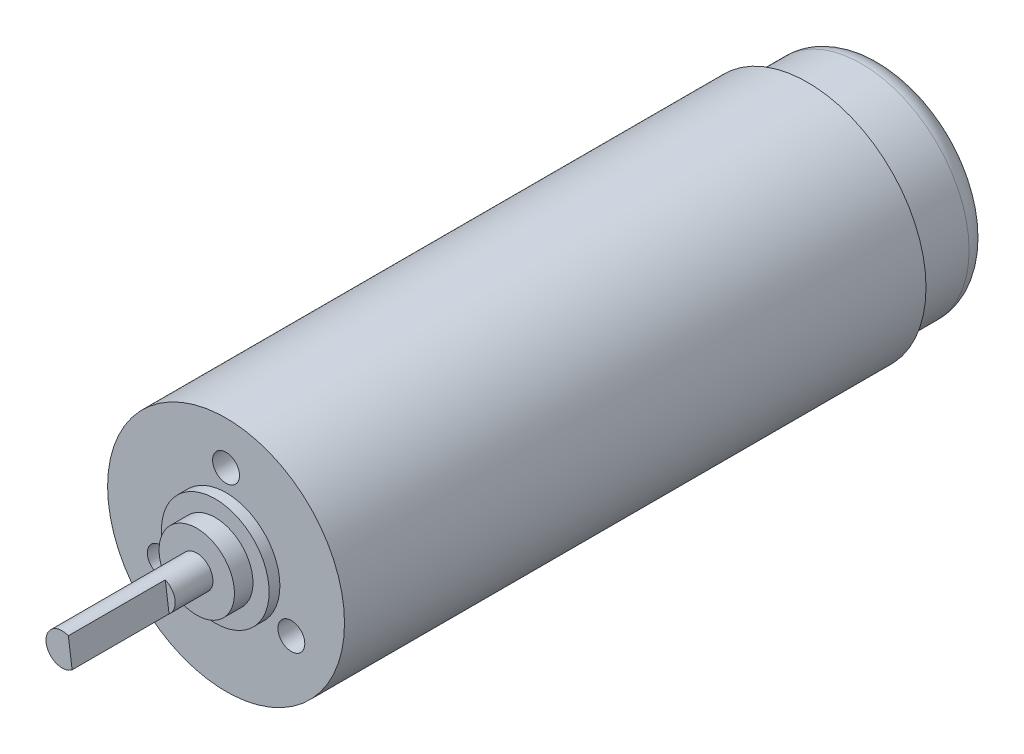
ISO-10303-21;
HEADER;
FILE_DESCRIPTION(('STEP AP214'),'2;1');
FILE_NAME('part.step','',(''),(''),'','','');
FILE_SCHEMA(('AUTOMOTIVE_DESIGN { 1 0 10303 214 1 1 1 1 }'));
ENDSEC;
DATA;
#1=APPLICATION_CONTEXT('core data for automotive mechanical design processes');
#2=APPLICATION_PROTOCOL_DEFINITION('international standard','automotive_design',2000,#1);
#3=PRODUCT_CONTEXT('',#1,'mechanical');
#4=PRODUCT('Part','Part','',(#3));
#5=PRODUCT_RELATED_PRODUCT_CATEGORY('part','',(#4));
#6=PRODUCT_DEFINITION_FORMATION('','',#4);
#7=PRODUCT_DEFINITION_CONTEXT('part definition',#1,'design');
#8=PRODUCT_DEFINITION('design','',#6,#7);
#9=PRODUCT_DEFINITION_SHAPE('','',#8);
#10=(LENGTH_UNIT() NAMED_UNIT(*) SI_UNIT(.MILLI.,.METRE.));
#11=(NAMED_UNIT(*) PLANE_ANGLE_UNIT() SI_UNIT($,.RADIAN.));
#12=(NAMED_UNIT(*) SI_UNIT($,.STERADIAN.) SOLID_ANGLE_UNIT());
#13=UNCERTAINTY_MEASURE_WITH_UNIT(LENGTH_MEASURE(1.E-05),#10,'distance_accuracy_value','');
#14=(GEOMETRIC_REPRESENTATION_CONTEXT(3) GLOBAL_UNCERTAINTY_ASSIGNED_CONTEXT((#13)) GLOBAL_UNIT_ASSIGNED_CONTEXT((#10,
#11,#12)) REPRESENTATION_CONTEXT('',''));
#15=CARTESIAN_POINT('',(0.,0.,0.));
#16=DIRECTION('',(0.,0.,1.));
#17=DIRECTION('',(1.,0.,0.));
#18=AXIS2_PLACEMENT_3D('',#15,#16,#17);
#19=CARTESIAN_POINT('',(0.,0.,7.));
#20=DIRECTION('',(0.,0.,-1.));
#21=DIRECTION('',(-1.,0.,0.));
#22=AXIS2_PLACEMENT_3D('',#19,#20,#21);
#23=CYLINDRICAL_SURFACE('',#22,10.);
#24=CARTESIAN_POINT('',(0.,0.,2.));
#25=DIRECTION('',(0.,0.,1.));
#26=DIRECTION('',(1.,0.,0.));
#27=AXIS2_PLACEMENT_3D('',#24,#25,#26);
#28=CIRCLE('',#27,10.);
#29=CARTESIAN_POINT('',(10.,0.,2.));
#30=VERTEX_POINT('',#29);
#31=EDGE_CURVE('E56',#30,#30,#28,.T.);
#32=ORIENTED_EDGE('',*,*,#31,.T.);
#33=EDGE_LOOP('',(#32));
#34=FACE_BOUND('',#33,.T.);
#35=CARTESIAN_POINT('',(0.,0.,7.));
#36=DIRECTION('',(0.,0.,1.));
#37=DIRECTION('',(1.,0.,0.));
#38=AXIS2_PLACEMENT_3D('',#35,#36,#37);
#39=CIRCLE('',#38,10.);
#40=CARTESIAN_POINT('',(10.,0.,7.));
#41=VERTEX_POINT('',#40);
#42=EDGE_CURVE('E125',#41,#41,#39,.T.);
#43=ORIENTED_EDGE('',*,*,#42,.F.);
#44=EDGE_LOOP('',(#43));
#45=FACE_BOUND('',#44,.T.);
#46=ADVANCED_FACE('F47',(#34,#45),#23,.T.);
#47=CARTESIAN_POINT('',(0.,0.,0.));
#48=DIRECTION('',(0.,0.,1.));
#49=DIRECTION('',(1.,0.,0.));
#50=AXIS2_PLACEMENT_3D('',#47,#48,#49);
#51=PLANE('',#50);
#52=CARTESIAN_POINT('',(0.,0.,0.));
#53=DIRECTION('',(0.,0.,1.));
#54=DIRECTION('',(1.,0.,0.));
#55=AXIS2_PLACEMENT_3D('',#52,#53,#54);
#56=CIRCLE('',#55,8.);
#57=CARTESIAN_POINT('',(8.,0.,0.));
#58=VERTEX_POINT('',#57);
#59=EDGE_CURVE('E11',#58,#58,#56,.F.);
#60=ORIENTED_EDGE('',*,*,#59,.T.);
#61=EDGE_LOOP('',(#60));
#62=FACE_BOUND('',#61,.T.);
#63=ADVANCED_FACE('F152',(#62),#51,.F.);
#64=CARTESIAN_POINT('',(0.,0.,61.));
#65=DIRECTION('',(0.,0.,-1.));
#66=DIRECTION('',(-1.,0.,0.));
#67=AXIS2_PLACEMENT_3D('',#64,#65,#66);
#68=CYLINDRICAL_SURFACE('',#67,11.);
#69=CARTESIAN_POINT('',(0.,0.,61.));
#70=DIRECTION('',(0.,0.,1.));
#71=DIRECTION('',(1.,0.,0.));
#72=AXIS2_PLACEMENT_3D('',#69,#70,#71);
#73=CIRCLE('',#72,11.);
#74=CARTESIAN_POINT('',(11.,0.,61.));
#75=VERTEX_POINT('',#74);
#76=EDGE_CURVE('E126',#75,#75,#73,.T.);
#77=ORIENTED_EDGE('',*,*,#76,.F.);
#78=EDGE_LOOP('',(#77));
#79=FACE_BOUND('',#78,.T.);
#80=CARTESIAN_POINT('',(0.,0.,7.));
#81=DIRECTION('',(0.,0.,1.));
#82=DIRECTION('',(1.,0.,0.));
#83=AXIS2_PLACEMENT_3D('',#80,#81,#82);
#84=CIRCLE('',#83,11.);
#85=CARTESIAN_POINT('',(11.,0.,7.));
#86=VERTEX_POINT('',#85);
#87=EDGE_CURVE('E121',#86,#86,#84,.T.);
#88=ORIENTED_EDGE('',*,*,#87,.T.);
#89=EDGE_LOOP('',(#88));
#90=FACE_BOUND('',#89,.T.);
#91=ADVANCED_FACE('F156',(#79,#90),#68,.T.);
#92=CARTESIAN_POINT('',(0.,0.,61.));
#93=DIRECTION('',(0.,0.,1.));
#94=DIRECTION('',(1.,0.,0.));
#95=AXIS2_PLACEMENT_3D('',#92,#93,#94);
#96=PLANE('',#95);
#97=CARTESIAN_POINT('',(-6.06217782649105,-3.50000000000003,61.));
#98=DIRECTION('',(0.,0.,1.));
#99=DIRECTION('',(-0.500000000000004,0.866025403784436,0.));
#100=AXIS2_PLACEMENT_3D('',#97,#98,#99);
#101=CIRCLE('',#100,1.25);
#102=CARTESIAN_POINT('',(-6.68717782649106,-2.41746824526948,61.));
#103=VERTEX_POINT('',#102);
#104=EDGE_CURVE('E223',#103,#103,#101,.T.);
#105=ORIENTED_EDGE('',*,*,#104,.F.);
#106=EDGE_LOOP('',(#105));
#107=FACE_BOUND('',#106,.T.);
#108=CARTESIAN_POINT('',(6.0621778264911,-3.49999999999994,61.));
#109=DIRECTION('',(0.,0.,1.));
#110=DIRECTION('',(-0.499999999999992,-0.866025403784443,0.));
#111=AXIS2_PLACEMENT_3D('',#108,#109,#110);
#112=CIRCLE('',#111,1.25);
#113=CARTESIAN_POINT('',(5.43717782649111,-4.5825317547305,61.));
#114=VERTEX_POINT('',#113);
#115=EDGE_CURVE('E231',#114,#114,#112,.T.);
#116=ORIENTED_EDGE('',*,*,#115,.F.);
#117=EDGE_LOOP('',(#116));
#118=FACE_BOUND('',#117,.T.);
#119=CARTESIAN_POINT('',(0.,7.,61.));
#120=DIRECTION('',(0.,0.,1.));
#121=DIRECTION('',(1.,0.,0.));
#122=AXIS2_PLACEMENT_3D('',#119,#120,#121);
#123=CIRCLE('',#122,1.25);
#124=CARTESIAN_POINT('',(1.25,7.,61.));
#125=VERTEX_POINT('',#124);
#126=EDGE_CURVE('E97',#125,#125,#123,.T.);
#127=ORIENTED_EDGE('',*,*,#126,.F.);
#128=EDGE_LOOP('',(#127));
#129=FACE_BOUND('',#128,.T.);
#130=CARTESIAN_POINT('',(0.,0.,61.));
#131=DIRECTION('',(0.,0.,1.));
#132=DIRECTION('',(1.,0.,0.));
#133=AXIS2_PLACEMENT_3D('',#130,#131,#132);
#134=CIRCLE('',#133,5.);
#135=CARTESIAN_POINT('',(5.,0.,61.));
#136=VERTEX_POINT('',#135);
#137=EDGE_CURVE('E117',#136,#136,#134,.T.);
#138=ORIENTED_EDGE('',*,*,#137,.F.);
#139=EDGE_LOOP('',(#138));
#140=FACE_BOUND('',#139,.T.);
#141=ORIENTED_EDGE('',*,*,#76,.T.);
#142=EDGE_LOOP('',(#141));
#143=FACE_BOUND('',#142,.T.);
#144=ADVANCED_FACE('F162',(#107,#118,#129,#140,#143),#96,.T.);
#145=CARTESIAN_POINT('',(0.,0.,7.));
#146=DIRECTION('',(0.,0.,1.));
#147=DIRECTION('',(1.,0.,0.));
#148=AXIS2_PLACEMENT_3D('',#145,#146,#147);
#149=PLANE('',#148);
#150=ORIENTED_EDGE('',*,*,#42,.T.);
#151=EDGE_LOOP('',(#150));
#152=FACE_BOUND('',#151,.T.);
#153=ORIENTED_EDGE('',*,*,#87,.F.);
#154=EDGE_LOOP('',(#153));
#155=FACE_BOUND('',#154,.T.);
#156=ADVANCED_FACE('F164',(#152,#155),#149,.F.);
#157=CARTESIAN_POINT('',(0.,0.,62.));
#158=DIRECTION('',(0.,0.,-1.));
#159=DIRECTION('',(-1.,0.,0.));
#160=AXIS2_PLACEMENT_3D('',#157,#158,#159);
#161=CYLINDRICAL_SURFACE('',#160,5.);
#162=CARTESIAN_POINT('',(0.,0.,62.));
#163=DIRECTION('',(0.,0.,1.));
#164=DIRECTION('',(1.,0.,0.));
#165=AXIS2_PLACEMENT_3D('',#162,#163,#164);
#166=CIRCLE('',#165,5.);
#167=CARTESIAN_POINT('',(5.,0.,62.));
#168=VERTEX_POINT('',#167);
#169=EDGE_CURVE('E113',#168,#168,#166,.T.);
#170=ORIENTED_EDGE('',*,*,#169,.F.);
#171=EDGE_LOOP('',(#170));
#172=FACE_BOUND('',#171,.T.);
#173=ORIENTED_EDGE('',*,*,#137,.T.);
#174=EDGE_LOOP('',(#173));
#175=FACE_BOUND('',#174,.T.);
#176=ADVANCED_FACE('F167',(#172,#175),#161,.T.);
#177=CARTESIAN_POINT('',(0.,0.,62.));
#178=DIRECTION('',(0.,0.,1.));
#179=DIRECTION('',(1.,0.,0.));
#180=AXIS2_PLACEMENT_3D('',#177,#178,#179);
#181=PLANE('',#180);
#182=CARTESIAN_POINT('',(0.,0.,62.));
#183=DIRECTION('',(0.,0.,1.));
#184=DIRECTION('',(1.,0.,0.));
#185=AXIS2_PLACEMENT_3D('',#182,#183,#184);
#186=CIRCLE('',#185,3.5);
#187=CARTESIAN_POINT('',(3.5,0.,62.));
#188=VERTEX_POINT('',#187);
#189=EDGE_CURVE('E109',#188,#188,#186,.T.);
#190=ORIENTED_EDGE('',*,*,#189,.F.);
#191=EDGE_LOOP('',(#190));
#192=FACE_BOUND('',#191,.T.);
#193=ORIENTED_EDGE('',*,*,#169,.T.);
#194=EDGE_LOOP('',(#193));
#195=FACE_BOUND('',#194,.T.);
#196=ADVANCED_FACE('F174',(#192,#195),#181,.T.);
#197=CARTESIAN_POINT('',(0.,0.,63.72));
#198=DIRECTION('',(0.,0.,-1.));
#199=DIRECTION('',(-1.,0.,0.));
#200=AXIS2_PLACEMENT_3D('',#197,#198,#199);
#201=CYLINDRICAL_SURFACE('',#200,3.5);
#202=CARTESIAN_POINT('',(0.,0.,63.72));
#203=DIRECTION('',(0.,0.,1.));
#204=DIRECTION('',(1.,0.,0.));
#205=AXIS2_PLACEMENT_3D('',#202,#203,#204);
#206=CIRCLE('',#205,3.5);
#207=CARTESIAN_POINT('',(3.5,0.,63.72));
#208=VERTEX_POINT('',#207);
#209=EDGE_CURVE('E104',#208,#208,#206,.T.);
#210=ORIENTED_EDGE('',*,*,#209,.F.);
#211=EDGE_LOOP('',(#210));
#212=FACE_BOUND('',#211,.T.);
#213=ORIENTED_EDGE('',*,*,#189,.T.);
#214=EDGE_LOOP('',(#213));
#215=FACE_BOUND('',#214,.T.);
#216=ADVANCED_FACE('F178',(#212,#215),#201,.T.);
#217=CARTESIAN_POINT('',(0.,0.,63.72));
#218=DIRECTION('',(0.,0.,1.));
#219=DIRECTION('',(1.,0.,0.));
#220=AXIS2_PLACEMENT_3D('',#217,#218,#219);
#221=PLANE('',#220);
#222=CARTESIAN_POINT('',(0.,0.,63.72));
#223=DIRECTION('',(0.,0.,1.));
#224=DIRECTION('',(1.,0.,0.));
#225=AXIS2_PLACEMENT_3D('',#222,#223,#224);
#226=CIRCLE('',#225,1.5);
#227=CARTESIAN_POINT('',(1.5,0.,63.72));
#228=VERTEX_POINT('',#227);
#229=EDGE_CURVE('E105',#228,#228,#226,.T.);
#230=ORIENTED_EDGE('',*,*,#229,.F.);
#231=EDGE_LOOP('',(#230));
#232=FACE_BOUND('',#231,.T.);
#233=ORIENTED_EDGE('',*,*,#209,.T.);
#234=EDGE_LOOP('',(#233));
#235=FACE_BOUND('',#234,.T.);
#236=ADVANCED_FACE('F182',(#232,#235),#221,.T.);
#237=CARTESIAN_POINT('',(0.,0.,76.22));
#238=DIRECTION('',(0.,0.,-1.));
#239=DIRECTION('',(-1.,0.,0.));
#240=AXIS2_PLACEMENT_3D('',#237,#238,#239);
#241=CYLINDRICAL_SURFACE('',#240,1.5);
#242=CARTESIAN_POINT('',(0.,0.,76.22));
#243=DIRECTION('',(0.,0.,1.));
#244=DIRECTION('',(1.,0.,0.));
#245=AXIS2_PLACEMENT_3D('',#242,#243,#244);
#246=CIRCLE('',#245,1.5);
#247=CARTESIAN_POINT('',(0.575645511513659,1.38514701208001,76.22));
#248=VERTEX_POINT('',#247);
#249=CARTESIAN_POINT('',(0.927585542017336,-1.17880662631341,76.22));
#250=VERTEX_POINT('',#249);
#251=EDGE_CURVE('E78',#248,#250,#246,.T.);
#252=ORIENTED_EDGE('',*,*,#251,.F.);
#253=DIRECTION('',(0.,0.,-1.));
#254=VECTOR('',#253,1.);
#255=CARTESIAN_POINT('',(0.575645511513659,1.38514701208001,265.651878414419));
#256=LINE('',#255,#254);
#257=CARTESIAN_POINT('',(0.575645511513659,1.38514701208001,67.22));
#258=VERTEX_POINT('',#257);
#259=EDGE_CURVE('E75',#248,#258,#256,.T.);
#260=ORIENTED_EDGE('',*,*,#259,.T.);
#261=CARTESIAN_POINT('',(0.,0.,67.22));
#262=DIRECTION('',(0.,0.,1.));
#263=DIRECTION('',(1.,0.,0.));
#264=AXIS2_PLACEMENT_3D('',#261,#262,#263);
#265=CIRCLE('',#264,1.5);
#266=CARTESIAN_POINT('',(0.927585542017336,-1.17880662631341,67.22));
#267=VERTEX_POINT('',#266);
#268=EDGE_CURVE('E63',#267,#258,#265,.T.);
#269=ORIENTED_EDGE('',*,*,#268,.F.);
#270=DIRECTION('',(0.,0.,-1.));
#271=VECTOR('',#270,1.);
#272=CARTESIAN_POINT('',(0.927585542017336,-1.17880662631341,265.651878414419));
#273=LINE('',#272,#271);
#274=EDGE_CURVE('E68',#250,#267,#273,.T.);
#275=ORIENTED_EDGE('',*,*,#274,.F.);
#276=EDGE_LOOP('',(#252,#260,#269,#275));
#277=FACE_BOUND('',#276,.T.);
#278=ORIENTED_EDGE('',*,*,#229,.T.);
#279=EDGE_LOOP('',(#278));
#280=FACE_BOUND('',#279,.T.);
#281=ADVANCED_FACE('F76',(#277,#280),#241,.T.);
#282=CARTESIAN_POINT('',(0.,0.,76.22));
#283=DIRECTION('',(0.,0.,1.));
#284=DIRECTION('',(1.,0.,0.));
#285=AXIS2_PLACEMENT_3D('',#282,#283,#284);
#286=PLANE('',#285);
#287=DIRECTION('',(0.135989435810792,-0.99071028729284,0.));
#288=VECTOR('',#287,1.);
#289=CARTESIAN_POINT('',(0.575645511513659,1.38514701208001,76.22));
#290=LINE('',#289,#288);
#291=EDGE_CURVE('E83',#248,#250,#290,.T.);
#292=ORIENTED_EDGE('',*,*,#291,.F.);
#293=ORIENTED_EDGE('',*,*,#251,.T.);
#294=EDGE_LOOP('',(#292,#293));
#295=FACE_BOUND('',#294,.T.);
#296=ADVANCED_FACE('F189',(#295),#286,.T.);
#297=CARTESIAN_POINT('',(0.575645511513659,1.38514701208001,265.651878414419));
#298=DIRECTION('',(0.99071028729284,0.135989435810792,0.));
#299=DIRECTION('',(-0.135989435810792,0.99071028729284,0.));
#300=AXIS2_PLACEMENT_3D('',#297,#298,#299);
#301=PLANE('',#300);
#302=ORIENTED_EDGE('',*,*,#259,.F.);
#303=ORIENTED_EDGE('',*,*,#291,.T.);
#304=ORIENTED_EDGE('',*,*,#274,.T.);
#305=DIRECTION('',(0.135989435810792,-0.99071028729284,0.));
#306=VECTOR('',#305,1.);
#307=CARTESIAN_POINT('',(0.575645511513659,1.38514701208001,67.22));
#308=LINE('',#307,#306);
#309=EDGE_CURVE('E87',#258,#267,#308,.T.);
#310=ORIENTED_EDGE('',*,*,#309,.F.);
#311=EDGE_LOOP('',(#302,#303,#304,#310));
#312=FACE_BOUND('',#311,.T.);
#313=ADVANCED_FACE('F91',(#312),#301,.T.);
#314=CARTESIAN_POINT('',(0.,0.,67.22));
#315=DIRECTION('',(0.,0.,1.));
#316=DIRECTION('',(1.,0.,0.));
#317=AXIS2_PLACEMENT_3D('',#314,#315,#316);
#318=PLANE('',#317);
#319=ORIENTED_EDGE('',*,*,#309,.T.);
#320=ORIENTED_EDGE('',*,*,#268,.T.);
#321=EDGE_LOOP('',(#319,#320));
#322=FACE_BOUND('',#321,.T.);
#323=ADVANCED_FACE('F86',(#322),#318,.T.);
#324=CARTESIAN_POINT('',(0.,7.,52.));
#325=DIRECTION('',(0.,0.,1.));
#326=DIRECTION('',(1.,0.,0.));
#327=AXIS2_PLACEMENT_3D('',#324,#325,#326);
#328=CYLINDRICAL_SURFACE('',#327,1.25);
#329=CARTESIAN_POINT('',(0.,7.,52.));
#330=DIRECTION('',(0.,0.,1.));
#331=DIRECTION('',(1.,0.,0.));
#332=AXIS2_PLACEMENT_3D('',#329,#330,#331);
#333=CIRCLE('',#332,1.25);
#334=CARTESIAN_POINT('',(1.25,7.,52.));
#335=VERTEX_POINT('',#334);
#336=EDGE_CURVE('E89',#335,#335,#333,.T.);
#337=ORIENTED_EDGE('',*,*,#336,.F.);
#338=EDGE_LOOP('',(#337));
#339=FACE_BOUND('',#338,.T.);
#340=ORIENTED_EDGE('',*,*,#126,.T.);
#341=EDGE_LOOP('',(#340));
#342=FACE_BOUND('',#341,.T.);
#343=ADVANCED_FACE('F195',(#339,#342),#328,.F.);
#344=CARTESIAN_POINT('',(0.,7.,52.));
#345=DIRECTION('',(0.,0.,1.));
#346=DIRECTION('',(1.,0.,0.));
#347=AXIS2_PLACEMENT_3D('',#344,#345,#346);
#348=PLANE('',#347);
#349=ORIENTED_EDGE('',*,*,#336,.T.);
#350=EDGE_LOOP('',(#349));
#351=FACE_BOUND('',#350,.T.);
#352=ADVANCED_FACE('F200',(#351),#348,.T.);
#353=CARTESIAN_POINT('',(6.0621778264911,-3.49999999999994,52.));
#354=DIRECTION('',(0.,0.,1.));
#355=DIRECTION('',(1.,0.,0.));
#356=AXIS2_PLACEMENT_3D('',#353,#354,#355);
#357=CYLINDRICAL_SURFACE('',#356,1.25);
#358=CARTESIAN_POINT('',(6.0621778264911,-3.49999999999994,52.));
#359=DIRECTION('',(0.,0.,1.));
#360=DIRECTION('',(-0.499999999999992,-0.866025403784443,0.));
#361=AXIS2_PLACEMENT_3D('',#358,#359,#360);
#362=CIRCLE('',#361,1.25);
#363=CARTESIAN_POINT('',(5.43717782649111,-4.5825317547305,52.));
#364=VERTEX_POINT('',#363);
#365=EDGE_CURVE('E225',#364,#364,#362,.T.);
#366=ORIENTED_EDGE('',*,*,#365,.F.);
#367=EDGE_LOOP('',(#366));
#368=FACE_BOUND('',#367,.T.);
#369=ORIENTED_EDGE('',*,*,#115,.T.);
#370=EDGE_LOOP('',(#369));
#371=FACE_BOUND('',#370,.T.);
#372=ADVANCED_FACE('F204',(#368,#371),#357,.F.);
#373=CARTESIAN_POINT('',(6.0621778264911,-3.49999999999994,52.));
#374=DIRECTION('',(0.,0.,1.));
#375=DIRECTION('',(-0.499999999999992,-0.866025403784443,0.));
#376=AXIS2_PLACEMENT_3D('',#373,#374,#375);
#377=PLANE('',#376);
#378=ORIENTED_EDGE('',*,*,#365,.T.);
#379=EDGE_LOOP('',(#378));
#380=FACE_BOUND('',#379,.T.);
#381=ADVANCED_FACE('F208',(#380),#377,.T.);
#382=CARTESIAN_POINT('',(-6.06217782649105,-3.50000000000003,52.));
#383=DIRECTION('',(0.,0.,1.));
#384=DIRECTION('',(1.,0.,0.));
#385=AXIS2_PLACEMENT_3D('',#382,#383,#384);
#386=CYLINDRICAL_SURFACE('',#385,1.25);
#387=CARTESIAN_POINT('',(-6.06217782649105,-3.50000000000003,52.));
#388=DIRECTION('',(0.,0.,1.));
#389=DIRECTION('',(-0.500000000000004,0.866025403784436,0.));
#390=AXIS2_PLACEMENT_3D('',#387,#388,#389);
#391=CIRCLE('',#390,1.25);
#392=CARTESIAN_POINT('',(-6.68717782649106,-2.41746824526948,52.));
#393=VERTEX_POINT('',#392);
#394=EDGE_CURVE('E220',#393,#393,#391,.T.);
#395=ORIENTED_EDGE('',*,*,#394,.F.);
#396=EDGE_LOOP('',(#395));
#397=FACE_BOUND('',#396,.T.);
#398=ORIENTED_EDGE('',*,*,#104,.T.);
#399=EDGE_LOOP('',(#398));
#400=FACE_BOUND('',#399,.T.);
#401=ADVANCED_FACE('F147',(#397,#400),#386,.F.);
#402=CARTESIAN_POINT('',(-6.06217782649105,-3.50000000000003,52.));
#403=DIRECTION('',(0.,0.,1.));
#404=DIRECTION('',(-0.500000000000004,0.866025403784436,0.));
#405=AXIS2_PLACEMENT_3D('',#402,#403,#404);
#406=PLANE('',#405);
#407=ORIENTED_EDGE('',*,*,#394,.T.);
#408=EDGE_LOOP('',(#407));
#409=FACE_BOUND('',#408,.T.);
#410=ADVANCED_FACE('F142',(#409),#406,.T.);
#411=CARTESIAN_POINT('',(0.,0.,2.));
#412=DIRECTION('',(0.,0.,1.));
#413=DIRECTION('',(1.,0.,0.));
#414=AXIS2_PLACEMENT_3D('',#411,#412,#413);
#415=TOROIDAL_SURFACE('',#414,8.,2.);
#416=ORIENTED_EDGE('',*,*,#59,.F.);
#417=EDGE_LOOP('',(#416));
#418=FACE_BOUND('',#417,.T.);
#419=ORIENTED_EDGE('',*,*,#31,.F.);
#420=EDGE_LOOP('',(#419));
#421=FACE_BOUND('',#420,.T.);
#422=ADVANCED_FACE('F49',(#418,#421),#415,.T.);
#423=CLOSED_SHELL('',(#46,#63,#91,#144,#156,#176,#196,#216,#236,#281,#296,#313,#323,#343,#352,
#372,#381,#401,#410,#422));
#424=MANIFOLD_SOLID_BREP('B2',#423);
#425=ADVANCED_BREP_SHAPE_REPRESENTATION('',(#18,#424),#14);
#426=SHAPE_DEFINITION_REPRESENTATION(#9,#425);
ENDSEC;
END-ISO-10303-21;
